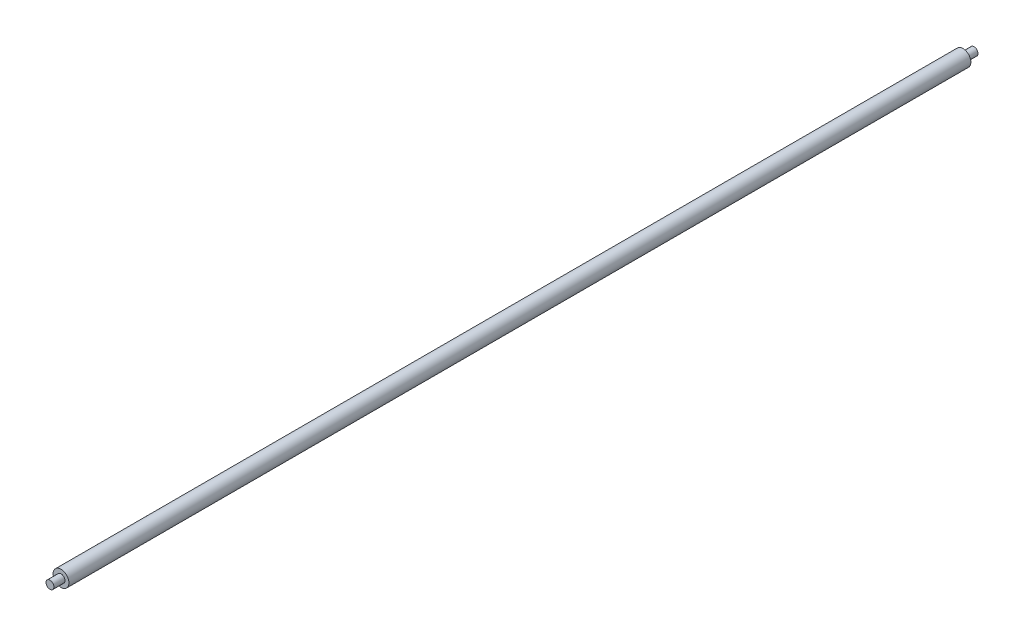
ISO-10303-21;
HEADER;
FILE_DESCRIPTION(('STEP AP214'),'2;1');
FILE_NAME('part.step','',(''),(''),'','','');
FILE_SCHEMA(('AUTOMOTIVE_DESIGN { 1 0 10303 214 1 1 1 1 }'));
ENDSEC;
DATA;
#1=APPLICATION_CONTEXT('core data for automotive mechanical design processes');
#2=APPLICATION_PROTOCOL_DEFINITION('international standard','automotive_design',2000,#1);
#3=PRODUCT_CONTEXT('',#1,'mechanical');
#4=PRODUCT('Part','Part','',(#3));
#5=PRODUCT_RELATED_PRODUCT_CATEGORY('part','',(#4));
#6=PRODUCT_DEFINITION_FORMATION('','',#4);
#7=PRODUCT_DEFINITION_CONTEXT('part definition',#1,'design');
#8=PRODUCT_DEFINITION('design','',#6,#7);
#9=PRODUCT_DEFINITION_SHAPE('','',#8);
#10=(LENGTH_UNIT() NAMED_UNIT(*) SI_UNIT(.MILLI.,.METRE.));
#11=(NAMED_UNIT(*) PLANE_ANGLE_UNIT() SI_UNIT($,.RADIAN.));
#12=(NAMED_UNIT(*) SI_UNIT($,.STERADIAN.) SOLID_ANGLE_UNIT());
#13=UNCERTAINTY_MEASURE_WITH_UNIT(LENGTH_MEASURE(1.E-05),#10,'distance_accuracy_value','');
#14=(GEOMETRIC_REPRESENTATION_CONTEXT(3) GLOBAL_UNCERTAINTY_ASSIGNED_CONTEXT((#13)) GLOBAL_UNIT_ASSIGNED_CONTEXT((#10,
#11,#12)) REPRESENTATION_CONTEXT('',''));
#15=CARTESIAN_POINT('',(0.,0.,0.));
#16=DIRECTION('',(0.,0.,1.));
#17=DIRECTION('',(1.,0.,0.));
#18=AXIS2_PLACEMENT_3D('',#15,#16,#17);
#19=CARTESIAN_POINT('',(0.,0.,570.));
#20=DIRECTION('',(0.,0.,1.));
#21=DIRECTION('',(1.,0.,0.));
#22=AXIS2_PLACEMENT_3D('',#19,#20,#21);
#23=PLANE('',#22);
#24=CARTESIAN_POINT('',(0.,0.,570.));
#25=DIRECTION('',(0.,0.,1.));
#26=DIRECTION('',(1.,0.,0.));
#27=AXIS2_PLACEMENT_3D('',#24,#25,#26);
#28=CIRCLE('',#27,5.);
#29=CARTESIAN_POINT('',(5.,0.,570.));
#30=VERTEX_POINT('',#29);
#31=EDGE_CURVE('E38',#30,#30,#28,.T.);
#32=ORIENTED_EDGE('',*,*,#31,.T.);
#33=EDGE_LOOP('',(#32));
#34=FACE_BOUND('',#33,.T.);
#35=CARTESIAN_POINT('',(0.,0.,570.));
#36=DIRECTION('',(0.,0.,1.));
#37=DIRECTION('',(1.,0.,0.));
#38=AXIS2_PLACEMENT_3D('',#35,#36,#37);
#39=CIRCLE('',#38,2.5);
#40=CARTESIAN_POINT('',(2.5,0.,570.));
#41=VERTEX_POINT('',#40);
#42=EDGE_CURVE('E52',#41,#41,#39,.T.);
#43=ORIENTED_EDGE('',*,*,#42,.F.);
#44=EDGE_LOOP('',(#43));
#45=FACE_BOUND('',#44,.T.);
#46=ADVANCED_FACE('F31',(#34,#45),#23,.T.);
#47=CARTESIAN_POINT('',(0.,0.,0.));
#48=DIRECTION('',(0.,0.,1.));
#49=DIRECTION('',(1.,0.,0.));
#50=AXIS2_PLACEMENT_3D('',#47,#48,#49);
#51=PLANE('',#50);
#52=CARTESIAN_POINT('',(0.,0.,0.));
#53=DIRECTION('',(0.,0.,1.));
#54=DIRECTION('',(1.,0.,0.));
#55=AXIS2_PLACEMENT_3D('',#52,#53,#54);
#56=CIRCLE('',#55,5.);
#57=CARTESIAN_POINT('',(5.,0.,0.));
#58=VERTEX_POINT('',#57);
#59=EDGE_CURVE('E42',#58,#58,#56,.T.);
#60=ORIENTED_EDGE('',*,*,#59,.F.);
#61=EDGE_LOOP('',(#60));
#62=FACE_BOUND('',#61,.T.);
#63=CARTESIAN_POINT('',(0.,0.,0.));
#64=DIRECTION('',(0.,0.,1.));
#65=DIRECTION('',(1.,0.,0.));
#66=AXIS2_PLACEMENT_3D('',#63,#64,#65);
#67=CIRCLE('',#66,2.5);
#68=CARTESIAN_POINT('',(2.5,0.,0.));
#69=VERTEX_POINT('',#68);
#70=EDGE_CURVE('E10',#69,#69,#67,.F.);
#71=ORIENTED_EDGE('',*,*,#70,.F.);
#72=EDGE_LOOP('',(#71));
#73=FACE_BOUND('',#72,.T.);
#74=ADVANCED_FACE('F68',(#62,#73),#51,.F.);
#75=CARTESIAN_POINT('',(0.,0.,570.));
#76=DIRECTION('',(0.,0.,-1.));
#77=DIRECTION('',(-1.,0.,0.));
#78=AXIS2_PLACEMENT_3D('',#75,#76,#77);
#79=CYLINDRICAL_SURFACE('',#78,5.);
#80=ORIENTED_EDGE('',*,*,#31,.F.);
#81=EDGE_LOOP('',(#80));
#82=FACE_BOUND('',#81,.T.);
#83=ORIENTED_EDGE('',*,*,#59,.T.);
#84=EDGE_LOOP('',(#83));
#85=FACE_BOUND('',#84,.T.);
#86=ADVANCED_FACE('F33',(#82,#85),#79,.T.);
#87=CARTESIAN_POINT('',(0.,0.,-7.));
#88=DIRECTION('',(0.,0.,1.));
#89=DIRECTION('',(1.,0.,0.));
#90=AXIS2_PLACEMENT_3D('',#87,#88,#89);
#91=CYLINDRICAL_SURFACE('',#90,2.5);
#92=CARTESIAN_POINT('',(0.,0.,-7.));
#93=DIRECTION('',(0.,0.,-1.));
#94=DIRECTION('',(-1.,0.,0.));
#95=AXIS2_PLACEMENT_3D('',#92,#93,#94);
#96=CIRCLE('',#95,2.5);
#97=CARTESIAN_POINT('',(-2.5,0.,-7.));
#98=VERTEX_POINT('',#97);
#99=EDGE_CURVE('E47',#98,#98,#96,.T.);
#100=ORIENTED_EDGE('',*,*,#99,.F.);
#101=EDGE_LOOP('',(#100));
#102=FACE_BOUND('',#101,.T.);
#103=ORIENTED_EDGE('',*,*,#70,.T.);
#104=EDGE_LOOP('',(#103));
#105=FACE_BOUND('',#104,.T.);
#106=ADVANCED_FACE('F75',(#102,#105),#91,.T.);
#107=CARTESIAN_POINT('',(0.,0.,-7.));
#108=DIRECTION('',(0.,0.,-1.));
#109=DIRECTION('',(-1.,0.,0.));
#110=AXIS2_PLACEMENT_3D('',#107,#108,#109);
#111=PLANE('',#110);
#112=ORIENTED_EDGE('',*,*,#99,.T.);
#113=EDGE_LOOP('',(#112));
#114=FACE_BOUND('',#113,.T.);
#115=ADVANCED_FACE('F63',(#114),#111,.T.);
#116=CARTESIAN_POINT('',(0.,0.,577.));
#117=DIRECTION('',(0.,0.,-1.));
#118=DIRECTION('',(-1.,0.,0.));
#119=AXIS2_PLACEMENT_3D('',#116,#117,#118);
#120=CYLINDRICAL_SURFACE('',#119,2.5);
#121=CARTESIAN_POINT('',(0.,0.,577.));
#122=DIRECTION('',(0.,0.,1.));
#123=DIRECTION('',(1.,0.,0.));
#124=AXIS2_PLACEMENT_3D('',#121,#122,#123);
#125=CIRCLE('',#124,2.5);
#126=CARTESIAN_POINT('',(2.5,0.,577.));
#127=VERTEX_POINT('',#126);
#128=EDGE_CURVE('E51',#127,#127,#125,.T.);
#129=ORIENTED_EDGE('',*,*,#128,.F.);
#130=EDGE_LOOP('',(#129));
#131=FACE_BOUND('',#130,.T.);
#132=ORIENTED_EDGE('',*,*,#42,.T.);
#133=EDGE_LOOP('',(#132));
#134=FACE_BOUND('',#133,.T.);
#135=ADVANCED_FACE('F60',(#131,#134),#120,.T.);
#136=CARTESIAN_POINT('',(0.,0.,577.));
#137=DIRECTION('',(0.,0.,1.));
#138=DIRECTION('',(1.,0.,0.));
#139=AXIS2_PLACEMENT_3D('',#136,#137,#138);
#140=PLANE('',#139);
#141=ORIENTED_EDGE('',*,*,#128,.T.);
#142=EDGE_LOOP('',(#141));
#143=FACE_BOUND('',#142,.T.);
#144=ADVANCED_FACE('F58',(#143),#140,.T.);
#145=CLOSED_SHELL('',(#46,#74,#86,#106,#115,#135,#144));
#146=MANIFOLD_SOLID_BREP('B2',#145);
#147=ADVANCED_BREP_SHAPE_REPRESENTATION('',(#18,#146),#14);
#148=SHAPE_DEFINITION_REPRESENTATION(#9,#147);
ENDSEC;
END-ISO-10303-21;
